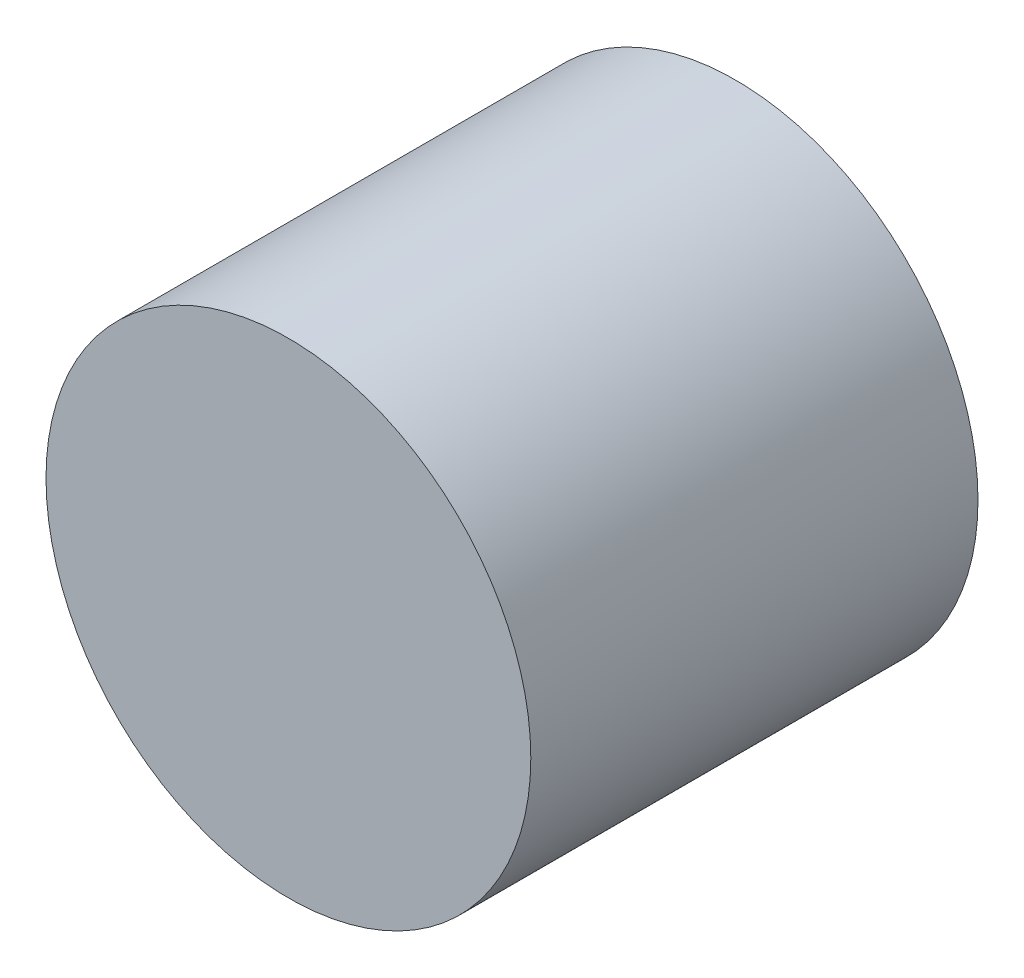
from build123d import *

# Parameters (mm, degrees)
ESQUISSE1_R        = 31.982873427
BOSS_EXTRU_1_DEPTH = 59


with BuildPart() as part:
    # Esquisse1 → Boss.-Extru.1 (new body)
    with BuildSketch(Plane.XY):
        Circle(ESQUISSE1_R)
    extrude(amount=BOSS_EXTRU_1_DEPTH)


solid = part.part
